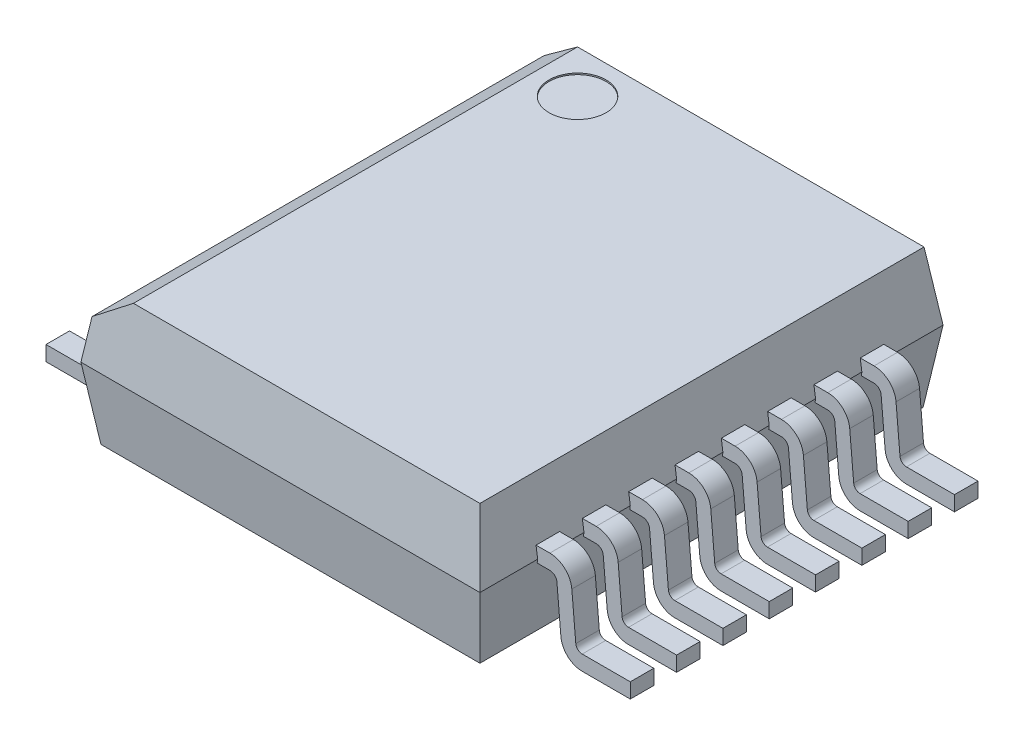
from build123d import *

# Parameters (mm, degrees)
EXTRUDE_1_DEPTH              = 0.165
SKETCH_5558_W                = 5.6
SKETCH_5558_H                = 6.5
EXTRUDE_5616_DEPTH           = 0.95
EXTRUDE_5616_TAPER           = 8
EXTRUDE_5616_OTHER_WAY_DEPTH = 1
EXTRUDE_5616_OTHER_WAY_TAPER = 8
PATTERN_LINEAR_5695_COUNT    = 8
PATTERN_LINEAR_5695_PITCH    = 0.65
CHAMFER_1_SIZE               = 0.4
CHAMFER_1_SIZE2              = 0.469982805
SKETCH_3_R                   = 0.4
CUT_EXTRUDE_3_DEPTH          = 0.02


with BuildPart() as part:
    # Sketch 1 → Extrude 1 (new, symmetric)
    with BuildSketch(Plane.XY.offset(-2.275)):
        with BuildLine():
            Line((-4.1, 0), (-3.424899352, 0))
            ThreePointArc((-3.424899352, 0), (-3.22222229, 0.078816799), (-3.126040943, 0.273853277))
            Line((-3.126040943, 0.273853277), (-3.070497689, 0.908715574))
            ThreePointArc((-3.070497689, 0.908715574), (-3.03843724, 0.973727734), (-2.970878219, 1))
            Line((-2.970878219, 1), (2.970878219, 1))
            ThreePointArc((2.970878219, 1), (3.03843724, 0.973727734), (3.070497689, 0.908715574))
            Line((3.070497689, 0.908715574), (3.126040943, 0.273853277))
            ThreePointArc((3.126040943, 0.273853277), (3.22222229, 0.078816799), (3.424899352, 0))
            Line((3.424899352, 0), (4.1, 0))
            Line((4.1, 0), (4.1, 0.21))
            Line((4.1, 0.21), (3.424899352, 0.21))
            ThreePointArc((3.424899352, 0.21), (3.364096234, 0.23364504), (3.335241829, 0.292155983))
            Line((3.335241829, 0.292155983), (3.279698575, 0.92701828))
            ThreePointArc((3.279698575, 0.92701828), (3.180311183, 1.128555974), (2.970878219, 1.21))
            Line((2.970878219, 1.21), (-2.970878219, 1.21))
            ThreePointArc((-2.970878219, 1.21), (-3.180311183, 1.128555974), (-3.279698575, 0.92701828))
            Line((-3.279698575, 0.92701828), (-3.335241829, 0.292155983))
            ThreePointArc((-3.335241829, 0.292155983), (-3.364096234, 0.23364504), (-3.424899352, 0.21))
            Line((-3.424899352, 0.21), (-4.1, 0.21))
            Line((-4.1, 0.21), (-4.1, 0))
        make_face()
    extrude_1 = extrude(amount=EXTRUDE_1_DEPTH, both=True)

    # Sketch 5558 → Extrude 5616 (add)
    with BuildSketch(Plane(origin=(0, 1.05, 0), x_dir=(1, 0, 0), z_dir=(0, 1, 0))):
        Rectangle(SKETCH_5558_W, SKETCH_5558_H)
    extrude(amount=EXTRUDE_5616_DEPTH, taper=EXTRUDE_5616_TAPER)

    # Sketch 5558 → Extrude 5616 other way (add)
    with BuildSketch(Plane(origin=(0, 1.05, 0), x_dir=(1, 0, 0), z_dir=(0, 1, 0))):
        Rectangle(SKETCH_5558_W, SKETCH_5558_H)
    extrude(amount=-EXTRUDE_5616_OTHER_WAY_DEPTH, taper=EXTRUDE_5616_OTHER_WAY_TAPER)

    # Pattern Linear 5695: Extrude 1 ×8
    with Locations(*[(0, 0, i * PATTERN_LINEAR_5695_PITCH) for i in range(1, PATTERN_LINEAR_5695_COUNT)]):
        add(extrude_1)

    # Chamfer 1
    chamfer_1_edges = [part.edges().sort_by_distance(p)[0] for p in [
        (-2.666486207, 2, 0),
    ]]
    chamfer_1_side = [part.faces().sort_by_distance(p)[0] for p in [
        (-2.729576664, 1.551088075, 0),
    ]]
    chamfer(chamfer_1_edges, length=CHAMFER_1_SIZE, length2=CHAMFER_1_SIZE2, reference=chamfer_1_side[0])

    # Sketch 3 → Cut-Extrude 3 (cut)
    with BuildSketch(Plane(origin=(0, 2, 0), x_dir=(1, 0, 0), z_dir=(0, 1, 0))):
        with Locations(Location((-1.596503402, 2.516486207, 0), (0, 0, 270))):
            Circle(SKETCH_3_R)
    extrude(amount=-CUT_EXTRUDE_3_DEPTH, mode=Mode.SUBTRACT)


solid = part.part
